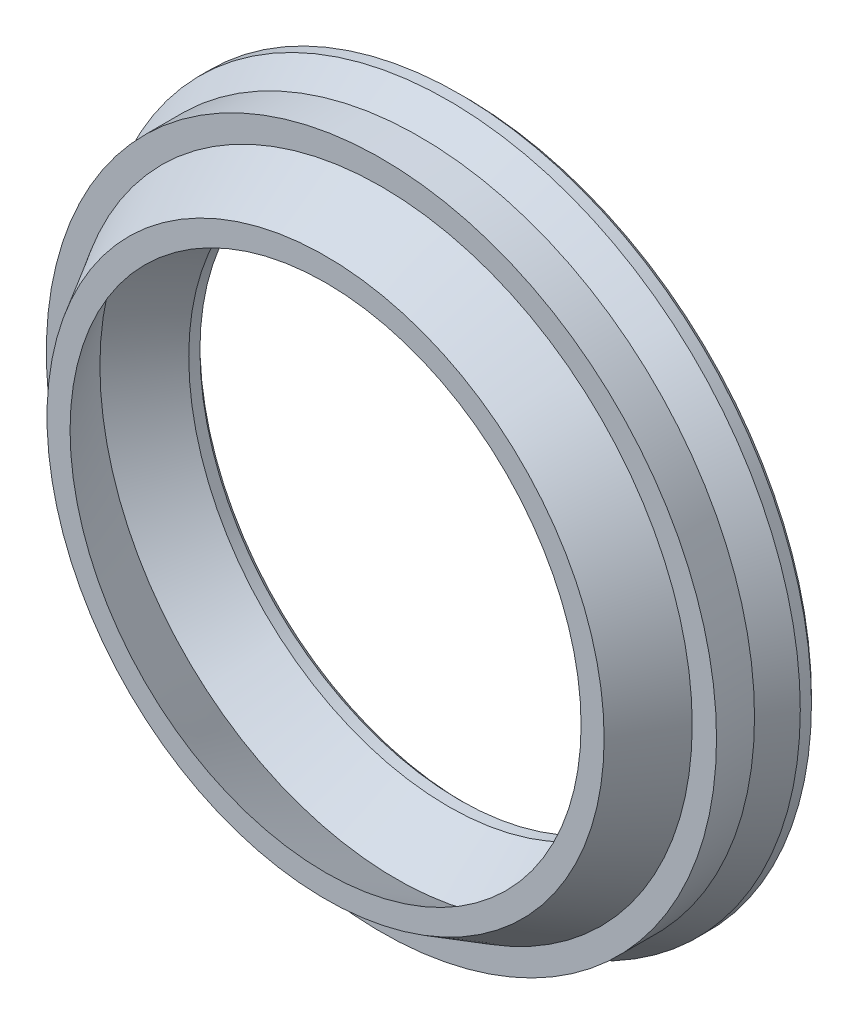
from build123d import *

# Parameters (mm, degrees)
ENDCHAMFER_SIZE = 0.333333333


with BuildPart() as part:
    # Sketch1 → Body (revolve)
    with BuildSketch(Plane(origin=(21, 0, -3.148731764), x_dir=(-1, 0, 0), z_dir=(0, 1, 0)), mode=Mode.PRIVATE) as body_sk:
        Polygon((41, -2.452550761), (41, -0.184601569), (39.549500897, -0.184601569), (37.625, 3.148731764), (36.25, 3.148731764), (38.683508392, -1.066228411), (36.5, -4.184601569), (36.5, -5.184601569), (42, -5.184601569), (42, -4.184601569), align=None)
    revolve(body_sk.sketch.rotate(Axis((0, 0, 7.495368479), (0, 0, -1)), 180), axis=Axis((0, 0, 7.495368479), (0, 0, -1)))

    # Sketch2 → Cut-Revolve1 (revolve, cut)
    with BuildSketch(Plane(origin=(19.25, 0, -11.337430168), x_dir=(-1, 0, 0), z_dir=(0, 1, 0))):
        Polygon((2, 3.004096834), (0, 3.004096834), (0.461880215, 3.804096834), (1.538119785, 3.804096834), align=None)
    revolve(axis=Axis((0, 0, 2.510986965), (0, 0, -1)), mode=Mode.SUBTRACT)

    # EndChamfer
    endchamfer_edges = [part.edges().sort_by_distance(p)[0] for p in [
        (-21, 0, -8.333333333),
        (-15.5, 0, -8.333333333),
    ]]
    chamfer(endchamfer_edges, length=ENDCHAMFER_SIZE)


solid = part.part
